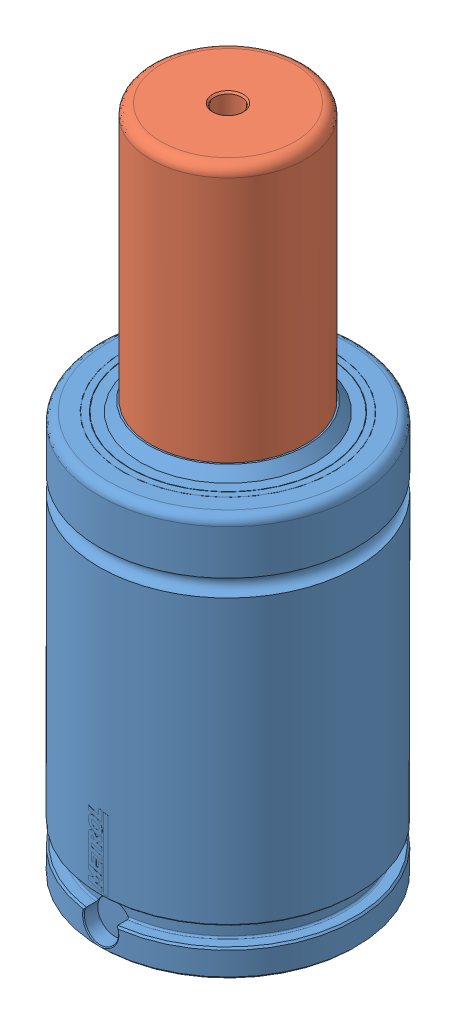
SolidWorks assembly EX2400-075.SLDASM, configuration Default (file format 7000). Lengths in mm.
Overall size (83.36 195 83.36).
2 component instances, 2 part files, 5 mates.
Components (placement in the parent):
- EX-2400 Body-1: EX-2400 Body.SLDPRT [EX-2500-075] x (0 0 1) z (0 -1 0) size (75.1 75 120)
- EX-2400 Piston-1: EX-2400 Piston.SLDPRT [EX-2500-075] at (0 102 0) x (-0.826731 0 0.562597) z (0 -1 0) size (60 60 93)
Mates (geometry in assembly coordinates):
- Concentric1: concentric anti-aligned: cylinder of EX-2400 Body-1 through (0 0 0) axis (0 -1 0) radius 22.5; cylinder of EX-2400 Piston-1 through (0 183.6906 0) axis (0 1 0) radius 22.5
- LimitDistance1: limit distance anti-aligned: plane of EX-2400 Body-1 through (-22.5 107 0) normal (0 -1 0); plane of EX-2400 Piston-1 through (-16.8779 107 -24.8019) normal (0 1 0)
- Coincident1: coincident anti-aligned: plane of EX-2400 Body-1 through (0 0 0) normal (0 -1 0); plane of assembly through (0 0 0) normal (0 1 0)
- Coincident3: coincident aligned: plane of EX-2400 Body-1; plane of assembly through (0 0 0) normal (0 0 1)
- Coincident4: coincident anti-aligned: plane of EX-2400 Body-1; plane of assembly through (0 0 0) normal (1 0 0)
